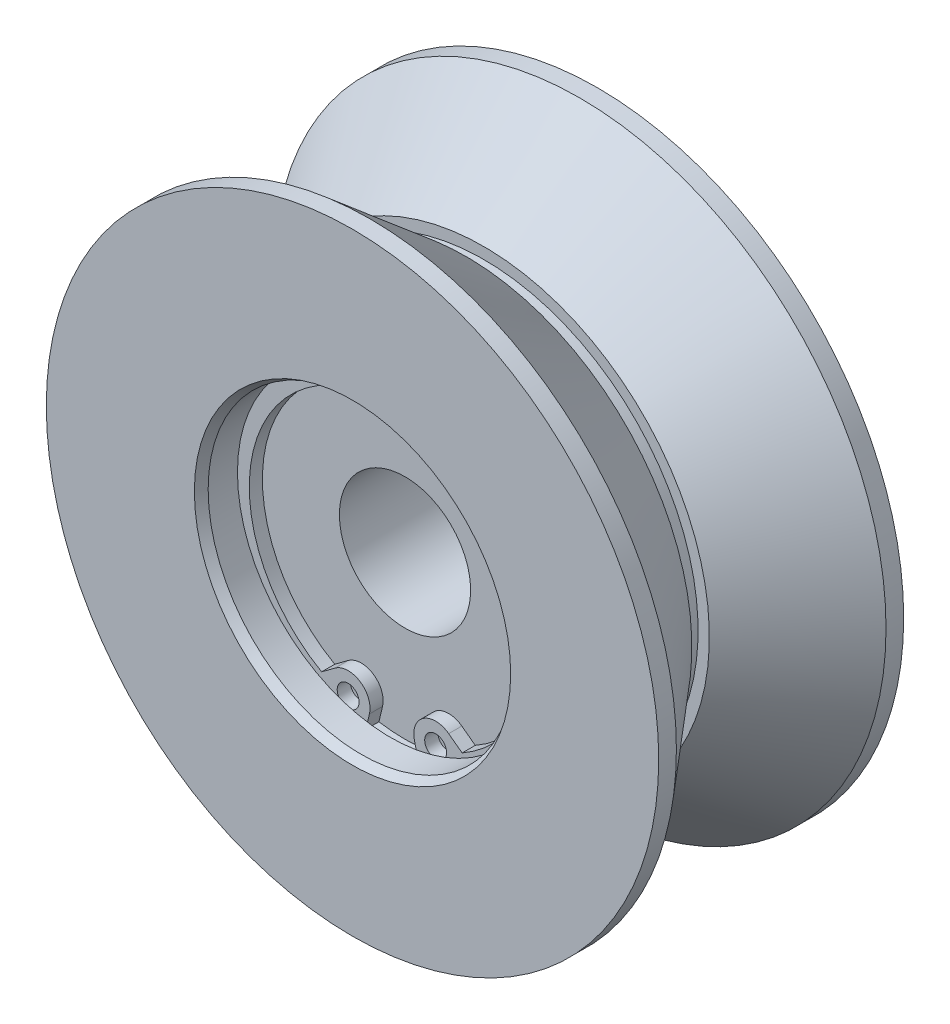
ISO-10303-21;
HEADER;
FILE_DESCRIPTION(('STEP AP214'),'2;1');
FILE_NAME('part.step','',(''),(''),'','','');
FILE_SCHEMA(('AUTOMOTIVE_DESIGN { 1 0 10303 214 1 1 1 1 }'));
ENDSEC;
DATA;
#1=APPLICATION_CONTEXT('core data for automotive mechanical design processes');
#2=APPLICATION_PROTOCOL_DEFINITION('international standard','automotive_design',2000,#1);
#3=PRODUCT_CONTEXT('',#1,'mechanical');
#4=PRODUCT('Part','Part','',(#3));
#5=PRODUCT_RELATED_PRODUCT_CATEGORY('part','',(#4));
#6=PRODUCT_DEFINITION_FORMATION('','',#4);
#7=PRODUCT_DEFINITION_CONTEXT('part definition',#1,'design');
#8=PRODUCT_DEFINITION('design','',#6,#7);
#9=PRODUCT_DEFINITION_SHAPE('','',#8);
#10=(LENGTH_UNIT() NAMED_UNIT(*) SI_UNIT(.MILLI.,.METRE.));
#11=(NAMED_UNIT(*) PLANE_ANGLE_UNIT() SI_UNIT($,.RADIAN.));
#12=(NAMED_UNIT(*) SI_UNIT($,.STERADIAN.) SOLID_ANGLE_UNIT());
#13=UNCERTAINTY_MEASURE_WITH_UNIT(LENGTH_MEASURE(1.E-05),#10,'distance_accuracy_value','');
#14=(GEOMETRIC_REPRESENTATION_CONTEXT(3) GLOBAL_UNCERTAINTY_ASSIGNED_CONTEXT((#13)) GLOBAL_UNIT_ASSIGNED_CONTEXT((#10,
#11,#12)) REPRESENTATION_CONTEXT('',''));
#15=CARTESIAN_POINT('',(0.,0.,0.));
#16=DIRECTION('',(0.,0.,1.));
#17=DIRECTION('',(1.,0.,0.));
#18=AXIS2_PLACEMENT_3D('',#15,#16,#17);
#19=CARTESIAN_POINT('',(5.,-15.9486107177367,9.6));
#20=DIRECTION('',(0.,0.,1.));
#21=DIRECTION('',(-1.,0.,0.));
#22=AXIS2_PLACEMENT_3D('',#19,#20,#21);
#23=CYLINDRICAL_SURFACE('',#22,2.5);
#24=DIRECTION('',(0.,0.,-1.));
#25=VECTOR('',#24,1.);
#26=CARTESIAN_POINT('',(2.5678231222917,-16.526983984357,9.6));
#27=LINE('',#26,#25);
#28=CARTESIAN_POINT('',(2.56782312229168,-16.526983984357,9.5));
#29=VERTEX_POINT('',#28);
#30=CARTESIAN_POINT('',(2.5678231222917,-16.526983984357,8.));
#31=VERTEX_POINT('',#30);
#32=EDGE_CURVE('E128',#29,#31,#27,.T.);
#33=ORIENTED_EDGE('',*,*,#32,.F.);
#34=CARTESIAN_POINT('',(5.,-15.9486107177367,9.5));
#35=DIRECTION('',(0.,0.,1.));
#36=DIRECTION('',(1.,0.,0.));
#37=AXIS2_PLACEMENT_3D('',#34,#35,#36);
#38=CIRCLE('',#37,2.5);
#39=CARTESIAN_POINT('',(6.49138441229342,-13.9421779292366,9.5));
#40=VERTEX_POINT('',#39);
#41=EDGE_CURVE('E205',#40,#29,#38,.T.);
#42=ORIENTED_EDGE('',*,*,#41,.F.);
#43=DIRECTION('',(0.,0.,-1.));
#44=VECTOR('',#43,1.);
#45=CARTESIAN_POINT('',(6.49138441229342,-13.9421779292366,9.6));
#46=LINE('',#45,#44);
#47=CARTESIAN_POINT('',(6.49138441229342,-13.9421779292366,8.));
#48=VERTEX_POINT('',#47);
#49=EDGE_CURVE('E145',#40,#48,#46,.T.);
#50=ORIENTED_EDGE('',*,*,#49,.T.);
#51=CARTESIAN_POINT('',(5.,-15.9486107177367,8.));
#52=DIRECTION('',(0.,0.,1.));
#53=DIRECTION('',(1.,0.,0.));
#54=AXIS2_PLACEMENT_3D('',#51,#52,#53);
#55=CIRCLE('',#54,2.5);
#56=EDGE_CURVE('E142',#48,#31,#55,.T.);
#57=ORIENTED_EDGE('',*,*,#56,.T.);
#58=EDGE_LOOP('',(#33,#42,#50,#57));
#59=FACE_BOUND('',#58,.T.);
#60=ADVANCED_FACE('F14',(#59),#23,.T.);
#61=CARTESIAN_POINT('',(6.49138441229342,-13.9421779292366,9.6));
#62=DIRECTION('',(-0.596553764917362,-0.802573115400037,0.));
#63=DIRECTION('',(-0.802573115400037,0.596553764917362,0.));
#64=AXIS2_PLACEMENT_3D('',#61,#62,#63);
#65=PLANE('',#64);
#66=DIRECTION('',(-0.802573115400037,0.596553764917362,0.));
#67=VECTOR('',#66,1.);
#68=CARTESIAN_POINT('',(8.02922574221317,-15.0852576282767,9.5));
#69=LINE('',#68,#67);
#70=CARTESIAN_POINT('',(8.02922574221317,-15.0852576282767,9.5));
#71=VERTEX_POINT('',#70);
#72=EDGE_CURVE('E233',#71,#40,#69,.T.);
#73=ORIENTED_EDGE('',*,*,#72,.F.);
#74=DIRECTION('',(0.,0.,-1.));
#75=VECTOR('',#74,1.);
#76=CARTESIAN_POINT('',(8.02922574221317,-15.0852576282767,9.6));
#77=LINE('',#76,#75);
#78=CARTESIAN_POINT('',(8.02922574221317,-15.0852576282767,8.));
#79=VERTEX_POINT('',#78);
#80=EDGE_CURVE('E141',#71,#79,#77,.T.);
#81=ORIENTED_EDGE('',*,*,#80,.T.);
#82=DIRECTION('',(-0.802573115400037,0.596553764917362,0.));
#83=VECTOR('',#82,1.);
#84=CARTESIAN_POINT('',(6.49138441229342,-13.9421779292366,8.));
#85=LINE('',#84,#83);
#86=EDGE_CURVE('E138',#79,#48,#85,.T.);
#87=ORIENTED_EDGE('',*,*,#86,.T.);
#88=ORIENTED_EDGE('',*,*,#49,.F.);
#89=EDGE_LOOP('',(#73,#81,#87,#88));
#90=FACE_BOUND('',#89,.T.);
#91=ADVANCED_FACE('F308',(#90),#65,.F.);
#92=CARTESIAN_POINT('',(0.,-0.9,9.6));
#93=DIRECTION('',(0.,0.,1.));
#94=DIRECTION('',(-1.,0.,0.));
#95=AXIS2_PLACEMENT_3D('',#92,#93,#94);
#96=CYLINDRICAL_SURFACE('',#95,16.3);
#97=CARTESIAN_POINT('',(0.,-0.9,9.5));
#98=DIRECTION('',(0.,0.,-1.));
#99=DIRECTION('',(1.,0.,0.));
#100=AXIS2_PLACEMENT_3D('',#97,#98,#99);
#101=CIRCLE('',#100,16.3);
#102=CARTESIAN_POINT('',(-8.02922574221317,-15.0852576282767,9.5));
#103=VERTEX_POINT('',#102);
#104=EDGE_CURVE('E104',#103,#71,#101,.T.);
#105=ORIENTED_EDGE('',*,*,#104,.F.);
#106=DIRECTION('',(0.,0.,-1.));
#107=VECTOR('',#106,1.);
#108=CARTESIAN_POINT('',(-8.02922574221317,-15.0852576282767,9.6));
#109=LINE('',#108,#107);
#110=CARTESIAN_POINT('',(-8.02922574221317,-15.0852576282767,8.));
#111=VERTEX_POINT('',#110);
#112=EDGE_CURVE('E103',#103,#111,#109,.T.);
#113=ORIENTED_EDGE('',*,*,#112,.T.);
#114=CARTESIAN_POINT('',(0.,-0.9,8.));
#115=DIRECTION('',(0.,0.,-1.));
#116=DIRECTION('',(0.,-1.,0.));
#117=AXIS2_PLACEMENT_3D('',#114,#115,#116);
#118=CIRCLE('',#117,16.3);
#119=EDGE_CURVE('E122',#111,#79,#118,.T.);
#120=ORIENTED_EDGE('',*,*,#119,.T.);
#121=ORIENTED_EDGE('',*,*,#80,.F.);
#122=EDGE_LOOP('',(#105,#113,#120,#121));
#123=FACE_BOUND('',#122,.T.);
#124=ADVANCED_FACE('F228',(#123),#96,.F.);
#125=CARTESIAN_POINT('',(-6.49138441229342,-13.9421779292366,9.6));
#126=DIRECTION('',(0.596553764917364,-0.802573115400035,0.));
#127=DIRECTION('',(0.,0.,-1.));
#128=AXIS2_PLACEMENT_3D('',#125,#126,#127);
#129=PLANE('',#128);
#130=DIRECTION('',(-0.802573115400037,-0.596553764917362,0.));
#131=VECTOR('',#130,1.);
#132=CARTESIAN_POINT('',(-6.49138441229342,-13.9421779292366,9.5));
#133=LINE('',#132,#131);
#134=CARTESIAN_POINT('',(-6.49138441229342,-13.9421779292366,9.5));
#135=VERTEX_POINT('',#134);
#136=EDGE_CURVE('E87',#135,#103,#133,.T.);
#137=ORIENTED_EDGE('',*,*,#136,.F.);
#138=DIRECTION('',(0.,0.,-1.));
#139=VECTOR('',#138,1.);
#140=CARTESIAN_POINT('',(-6.49138441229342,-13.9421779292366,9.6));
#141=LINE('',#140,#139);
#142=CARTESIAN_POINT('',(-6.49138441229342,-13.9421779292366,8.));
#143=VERTEX_POINT('',#142);
#144=EDGE_CURVE('E101',#135,#143,#141,.T.);
#145=ORIENTED_EDGE('',*,*,#144,.T.);
#146=DIRECTION('',(-0.802573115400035,-0.596553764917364,0.));
#147=VECTOR('',#146,1.);
#148=CARTESIAN_POINT('',(-6.49138441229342,-13.9421779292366,8.));
#149=LINE('',#148,#147);
#150=EDGE_CURVE('E110',#143,#111,#149,.T.);
#151=ORIENTED_EDGE('',*,*,#150,.T.);
#152=ORIENTED_EDGE('',*,*,#112,.F.);
#153=EDGE_LOOP('',(#137,#145,#151,#152));
#154=FACE_BOUND('',#153,.T.);
#155=ADVANCED_FACE('F100',(#154),#129,.F.);
#156=CARTESIAN_POINT('',(-5.,-15.9486107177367,9.6));
#157=DIRECTION('',(0.,0.,1.));
#158=DIRECTION('',(-1.,0.,0.));
#159=AXIS2_PLACEMENT_3D('',#156,#157,#158);
#160=CYLINDRICAL_SURFACE('',#159,2.5);
#161=ORIENTED_EDGE('',*,*,#144,.F.);
#162=CARTESIAN_POINT('',(-5.,-15.9486107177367,9.5));
#163=DIRECTION('',(0.,0.,1.));
#164=DIRECTION('',(1.,0.,0.));
#165=AXIS2_PLACEMENT_3D('',#162,#163,#164);
#166=CIRCLE('',#165,2.5);
#167=CARTESIAN_POINT('',(-2.56782312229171,-16.526983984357,9.5));
#168=VERTEX_POINT('',#167);
#169=EDGE_CURVE('E83',#168,#135,#166,.T.);
#170=ORIENTED_EDGE('',*,*,#169,.F.);
#171=DIRECTION('',(0.,0.,-1.));
#172=VECTOR('',#171,1.);
#173=CARTESIAN_POINT('',(-2.56782312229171,-16.526983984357,9.6));
#174=LINE('',#173,#172);
#175=CARTESIAN_POINT('',(-2.56782312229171,-16.526983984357,8.));
#176=VERTEX_POINT('',#175);
#177=EDGE_CURVE('E133',#168,#176,#174,.T.);
#178=ORIENTED_EDGE('',*,*,#177,.T.);
#179=CARTESIAN_POINT('',(-5.,-15.9486107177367,8.));
#180=DIRECTION('',(0.,0.,1.));
#181=DIRECTION('',(-1.,0.,0.));
#182=AXIS2_PLACEMENT_3D('',#179,#180,#181);
#183=CIRCLE('',#182,2.5);
#184=EDGE_CURVE('E107',#176,#143,#183,.T.);
#185=ORIENTED_EDGE('',*,*,#184,.T.);
#186=EDGE_LOOP('',(#161,#170,#178,#185));
#187=FACE_BOUND('',#186,.T.);
#188=ADVANCED_FACE('F106',(#187),#160,.T.);
#189=CARTESIAN_POINT('',(-2.56782312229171,-16.526983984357,9.6));
#190=DIRECTION('',(-0.97287075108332,0.231349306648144,0.));
#191=DIRECTION('',(0.,0.,1.));
#192=AXIS2_PLACEMENT_3D('',#189,#190,#191);
#193=PLANE('',#192);
#194=DIRECTION('',(0.,0.,-1.));
#195=VECTOR('',#194,1.);
#196=CARTESIAN_POINT('',(-2.97957431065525,-18.2584812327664,-15.4));
#197=LINE('',#196,#195);
#198=CARTESIAN_POINT('',(-2.97957431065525,-18.2584812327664,8.));
#199=VERTEX_POINT('',#198);
#200=CARTESIAN_POINT('',(-2.97957431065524,-18.2584812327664,9.5));
#201=VERTEX_POINT('',#200);
#202=EDGE_CURVE('E22',#199,#201,#197,.F.);
#203=ORIENTED_EDGE('',*,*,#202,.F.);
#204=DIRECTION('',(0.231349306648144,0.97287075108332,0.));
#205=VECTOR('',#204,1.);
#206=CARTESIAN_POINT('',(-2.56782312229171,-16.526983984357,8.));
#207=LINE('',#206,#205);
#208=EDGE_CURVE('E132',#199,#176,#207,.T.);
#209=ORIENTED_EDGE('',*,*,#208,.T.);
#210=ORIENTED_EDGE('',*,*,#177,.F.);
#211=DIRECTION('',(0.231349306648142,0.972870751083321,0.));
#212=VECTOR('',#211,1.);
#213=CARTESIAN_POINT('',(-3.07234735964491,-18.6486107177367,9.5));
#214=LINE('',#213,#212);
#215=EDGE_CURVE('E90',#201,#168,#214,.T.);
#216=ORIENTED_EDGE('',*,*,#215,.F.);
#217=EDGE_LOOP('',(#203,#209,#210,#216));
#218=FACE_BOUND('',#217,.T.);
#219=ADVANCED_FACE('F203',(#218),#193,.F.);
#220=CARTESIAN_POINT('',(2.5678231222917,-16.526983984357,9.6));
#221=DIRECTION('',(0.972870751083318,0.231349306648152,0.));
#222=DIRECTION('',(0.,0.,-1.));
#223=AXIS2_PLACEMENT_3D('',#220,#221,#222);
#224=PLANE('',#223);
#225=DIRECTION('',(0.,0.,-1.));
#226=VECTOR('',#225,1.);
#227=CARTESIAN_POINT('',(2.97957431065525,-18.2584812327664,-15.4));
#228=LINE('',#227,#226);
#229=CARTESIAN_POINT('',(2.97957431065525,-18.2584812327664,9.5));
#230=VERTEX_POINT('',#229);
#231=CARTESIAN_POINT('',(2.97957431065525,-18.2584812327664,8.));
#232=VERTEX_POINT('',#231);
#233=EDGE_CURVE('E9',#230,#232,#228,.T.);
#234=ORIENTED_EDGE('',*,*,#233,.F.);
#235=DIRECTION('',(0.231349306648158,-0.972870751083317,0.));
#236=VECTOR('',#235,1.);
#237=CARTESIAN_POINT('',(2.56782312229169,-16.526983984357,9.5));
#238=LINE('',#237,#236);
#239=EDGE_CURVE('E202',#29,#230,#238,.T.);
#240=ORIENTED_EDGE('',*,*,#239,.F.);
#241=ORIENTED_EDGE('',*,*,#32,.T.);
#242=DIRECTION('',(0.231349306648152,-0.972870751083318,0.));
#243=VECTOR('',#242,1.);
#244=CARTESIAN_POINT('',(2.5678231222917,-16.526983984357,8.));
#245=LINE('',#244,#243);
#246=EDGE_CURVE('E126',#31,#232,#245,.T.);
#247=ORIENTED_EDGE('',*,*,#246,.T.);
#248=EDGE_LOOP('',(#234,#240,#241,#247));
#249=FACE_BOUND('',#248,.T.);
#250=ADVANCED_FACE('F241',(#249),#224,.F.);
#251=CARTESIAN_POINT('',(-5.,-15.9486107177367,9.6));
#252=DIRECTION('',(0.,0.,1.));
#253=DIRECTION('',(-1.,0.,0.));
#254=AXIS2_PLACEMENT_3D('',#251,#252,#253);
#255=CYLINDRICAL_SURFACE('',#254,1.25);
#256=CARTESIAN_POINT('',(-5.,-15.9486107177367,8.));
#257=DIRECTION('',(0.,0.,-1.));
#258=DIRECTION('',(1.,0.,0.));
#259=AXIS2_PLACEMENT_3D('',#256,#257,#258);
#260=CIRCLE('',#259,1.25);
#261=CARTESIAN_POINT('',(-3.75,-15.9486107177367,8.));
#262=VERTEX_POINT('',#261);
#263=EDGE_CURVE('E134',#262,#262,#260,.T.);
#264=ORIENTED_EDGE('',*,*,#263,.T.);
#265=EDGE_LOOP('',(#264));
#266=FACE_BOUND('',#265,.T.);
#267=CARTESIAN_POINT('',(-5.,-15.9486107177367,9.5));
#268=DIRECTION('',(0.,0.,1.));
#269=DIRECTION('',(1.,0.,0.));
#270=AXIS2_PLACEMENT_3D('',#267,#268,#269);
#271=CIRCLE('',#270,1.25);
#272=CARTESIAN_POINT('',(-3.75,-15.9486107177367,9.5));
#273=VERTEX_POINT('',#272);
#274=EDGE_CURVE('E149',#273,#273,#271,.F.);
#275=ORIENTED_EDGE('',*,*,#274,.F.);
#276=EDGE_LOOP('',(#275));
#277=FACE_BOUND('',#276,.T.);
#278=ADVANCED_FACE('F272',(#266,#277),#255,.F.);
#279=CARTESIAN_POINT('',(5.,-15.9486107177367,9.6));
#280=DIRECTION('',(0.,0.,1.));
#281=DIRECTION('',(-1.,0.,0.));
#282=AXIS2_PLACEMENT_3D('',#279,#280,#281);
#283=CYLINDRICAL_SURFACE('',#282,1.25);
#284=CARTESIAN_POINT('',(5.,-15.9486107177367,8.));
#285=DIRECTION('',(0.,0.,1.));
#286=DIRECTION('',(1.,0.,0.));
#287=AXIS2_PLACEMENT_3D('',#284,#285,#286);
#288=CIRCLE('',#287,1.25);
#289=CARTESIAN_POINT('',(6.25,-15.9486107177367,8.));
#290=VERTEX_POINT('',#289);
#291=EDGE_CURVE('E111',#290,#290,#288,.T.);
#292=ORIENTED_EDGE('',*,*,#291,.F.);
#293=EDGE_LOOP('',(#292));
#294=FACE_BOUND('',#293,.T.);
#295=CARTESIAN_POINT('',(5.,-15.9486107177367,9.5));
#296=DIRECTION('',(0.,0.,1.));
#297=DIRECTION('',(1.,0.,0.));
#298=AXIS2_PLACEMENT_3D('',#295,#296,#297);
#299=CIRCLE('',#298,1.25);
#300=CARTESIAN_POINT('',(6.25,-15.9486107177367,9.5));
#301=VERTEX_POINT('',#300);
#302=EDGE_CURVE('E146',#301,#301,#299,.F.);
#303=ORIENTED_EDGE('',*,*,#302,.F.);
#304=EDGE_LOOP('',(#303));
#305=FACE_BOUND('',#304,.T.);
#306=ADVANCED_FACE('F268',(#294,#305),#283,.F.);
#307=CARTESIAN_POINT('',(-5.,-15.9486107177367,9.5));
#308=DIRECTION('',(0.,0.,1.));
#309=DIRECTION('',(1.,0.,0.));
#310=AXIS2_PLACEMENT_3D('',#307,#308,#309);
#311=PLANE('',#310);
#312=ORIENTED_EDGE('',*,*,#302,.T.);
#313=EDGE_LOOP('',(#312));
#314=FACE_BOUND('',#313,.T.);
#315=ORIENTED_EDGE('',*,*,#274,.T.);
#316=EDGE_LOOP('',(#315));
#317=FACE_BOUND('',#316,.T.);
#318=ORIENTED_EDGE('',*,*,#239,.T.);
#319=CARTESIAN_POINT('',(0.,0.,9.5));
#320=DIRECTION('',(0.,0.,1.));
#321=DIRECTION('',(1.,0.,0.));
#322=AXIS2_PLACEMENT_3D('',#319,#320,#321);
#323=CIRCLE('',#322,18.5);
#324=EDGE_CURVE('E118',#230,#201,#323,.T.);
#325=ORIENTED_EDGE('',*,*,#324,.T.);
#326=ORIENTED_EDGE('',*,*,#215,.T.);
#327=ORIENTED_EDGE('',*,*,#169,.T.);
#328=ORIENTED_EDGE('',*,*,#136,.T.);
#329=ORIENTED_EDGE('',*,*,#104,.T.);
#330=ORIENTED_EDGE('',*,*,#72,.T.);
#331=ORIENTED_EDGE('',*,*,#41,.T.);
#332=EDGE_LOOP('',(#318,#325,#326,#327,#328,#329,#330,#331));
#333=FACE_BOUND('',#332,.T.);
#334=ADVANCED_FACE('F86',(#314,#317,#333),#311,.T.);
#335=CARTESIAN_POINT('',(0.,0.,-15.4));
#336=DIRECTION('',(0.,0.,-1.));
#337=DIRECTION('',(-1.,0.,0.));
#338=AXIS2_PLACEMENT_3D('',#335,#336,#337);
#339=CYLINDRICAL_SURFACE('',#338,24.5);
#340=CARTESIAN_POINT('',(0.,0.,-1.));
#341=DIRECTION('',(0.,0.,-1.));
#342=DIRECTION('',(-1.,0.,0.));
#343=AXIS2_PLACEMENT_3D('',#340,#341,#342);
#344=CIRCLE('',#343,24.5);
#345=CARTESIAN_POINT('',(-24.5,0.,-1.));
#346=VERTEX_POINT('',#345);
#347=EDGE_CURVE('E180',#346,#346,#344,.T.);
#348=ORIENTED_EDGE('',*,*,#347,.F.);
#349=EDGE_LOOP('',(#348));
#350=FACE_BOUND('',#349,.T.);
#351=CARTESIAN_POINT('',(0.,0.,1.));
#352=DIRECTION('',(0.,0.,-1.));
#353=DIRECTION('',(-1.,0.,0.));
#354=AXIS2_PLACEMENT_3D('',#351,#352,#353);
#355=CIRCLE('',#354,24.5);
#356=CARTESIAN_POINT('',(-24.5,0.,1.));
#357=VERTEX_POINT('',#356);
#358=EDGE_CURVE('E177',#357,#357,#355,.T.);
#359=ORIENTED_EDGE('',*,*,#358,.T.);
#360=EDGE_LOOP('',(#359));
#361=FACE_BOUND('',#360,.T.);
#362=ADVANCED_FACE('F358',(#350,#361),#339,.T.);
#363=CARTESIAN_POINT('',(0.,25.7866860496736,-1.));
#364=DIRECTION('',(0.,0.,-1.));
#365=DIRECTION('',(-1.,0.,0.));
#366=AXIS2_PLACEMENT_3D('',#363,#364,#365);
#367=PLANE('',#366);
#368=CARTESIAN_POINT('',(0.,0.,-1.));
#369=DIRECTION('',(0.,0.,-1.));
#370=DIRECTION('',(-1.,0.,0.));
#371=AXIS2_PLACEMENT_3D('',#368,#369,#370);
#372=CIRCLE('',#371,25.7866860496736);
#373=CARTESIAN_POINT('',(-25.7866860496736,0.,-1.));
#374=VERTEX_POINT('',#373);
#375=EDGE_CURVE('E183',#374,#374,#372,.T.);
#376=ORIENTED_EDGE('',*,*,#375,.F.);
#377=EDGE_LOOP('',(#376));
#378=FACE_BOUND('',#377,.T.);
#379=ORIENTED_EDGE('',*,*,#347,.T.);
#380=EDGE_LOOP('',(#379));
#381=FACE_BOUND('',#380,.T.);
#382=ADVANCED_FACE('F368',(#378,#381),#367,.F.);
#383=CARTESIAN_POINT('',(0.,24.5,1.));
#384=DIRECTION('',(0.,0.,1.));
#385=DIRECTION('',(1.,0.,0.));
#386=AXIS2_PLACEMENT_3D('',#383,#384,#385);
#387=PLANE('',#386);
#388=ORIENTED_EDGE('',*,*,#358,.F.);
#389=EDGE_LOOP('',(#388));
#390=FACE_BOUND('',#389,.T.);
#391=CARTESIAN_POINT('',(0.,0.,1.));
#392=DIRECTION('',(0.,0.,-1.));
#393=DIRECTION('',(-1.,0.,0.));
#394=AXIS2_PLACEMENT_3D('',#391,#392,#393);
#395=CIRCLE('',#394,25.7866860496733);
#396=CARTESIAN_POINT('',(-25.7866860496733,0.,1.));
#397=VERTEX_POINT('',#396);
#398=EDGE_CURVE('E174',#397,#397,#395,.T.);
#399=ORIENTED_EDGE('',*,*,#398,.T.);
#400=EDGE_LOOP('',(#399));
#401=FACE_BOUND('',#400,.T.);
#402=ADVANCED_FACE('F371',(#390,#401),#387,.F.);
#403=CARTESIAN_POINT('',(0.,0.,-1.));
#404=DIRECTION('',(0.,0.,-1.));
#405=DIRECTION('',(-1.,0.,0.));
#406=AXIS2_PLACEMENT_3D('',#403,#404,#405);
#407=CONICAL_SURFACE('',#406,25.7866860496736,0.698131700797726);
#408=CARTESIAN_POINT('',(0.,0.,-11.98));
#409=DIRECTION('',(0.,0.,-1.));
#410=DIRECTION('',(-1.,0.,0.));
#411=AXIS2_PLACEMENT_3D('',#408,#409,#410);
#412=CIRCLE('',#411,35.);
#413=CARTESIAN_POINT('',(-35.,0.,-11.98));
#414=VERTEX_POINT('',#413);
#415=EDGE_CURVE('E186',#414,#414,#412,.T.);
#416=ORIENTED_EDGE('',*,*,#415,.F.);
#417=EDGE_LOOP('',(#416));
#418=FACE_BOUND('',#417,.T.);
#419=ORIENTED_EDGE('',*,*,#375,.T.);
#420=EDGE_LOOP('',(#419));
#421=FACE_BOUND('',#420,.T.);
#422=ADVANCED_FACE('F380',(#418,#421),#407,.T.);
#423=CARTESIAN_POINT('',(0.,0.,11.98));
#424=DIRECTION('',(0.,0.,1.));
#425=DIRECTION('',(1.,0.,0.));
#426=AXIS2_PLACEMENT_3D('',#423,#424,#425);
#427=CONICAL_SURFACE('',#426,35.,0.698131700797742);
#428=ORIENTED_EDGE('',*,*,#398,.F.);
#429=EDGE_LOOP('',(#428));
#430=FACE_BOUND('',#429,.T.);
#431=CARTESIAN_POINT('',(0.,0.,11.98));
#432=DIRECTION('',(0.,0.,-1.));
#433=DIRECTION('',(-1.,0.,0.));
#434=AXIS2_PLACEMENT_3D('',#431,#432,#433);
#435=CIRCLE('',#434,35.);
#436=CARTESIAN_POINT('',(-35.,0.,11.98));
#437=VERTEX_POINT('',#436);
#438=EDGE_CURVE('E189',#437,#437,#435,.T.);
#439=ORIENTED_EDGE('',*,*,#438,.T.);
#440=EDGE_LOOP('',(#439));
#441=FACE_BOUND('',#440,.T.);
#442=ADVANCED_FACE('F389',(#430,#441),#427,.T.);
#443=CARTESIAN_POINT('',(0.,0.,14.));
#444=DIRECTION('',(0.,0.,-1.));
#445=DIRECTION('',(-1.,0.,0.));
#446=AXIS2_PLACEMENT_3D('',#443,#444,#445);
#447=CYLINDRICAL_SURFACE('',#446,35.);
#448=ORIENTED_EDGE('',*,*,#415,.T.);
#449=EDGE_LOOP('',(#448));
#450=FACE_BOUND('',#449,.T.);
#451=CARTESIAN_POINT('',(0.,0.,-14.));
#452=DIRECTION('',(0.,0.,1.));
#453=DIRECTION('',(1.,0.,0.));
#454=AXIS2_PLACEMENT_3D('',#451,#452,#453);
#455=CIRCLE('',#454,35.);
#456=CARTESIAN_POINT('',(35.,0.,-14.));
#457=VERTEX_POINT('',#456);
#458=EDGE_CURVE('E158',#457,#457,#455,.T.);
#459=ORIENTED_EDGE('',*,*,#458,.T.);
#460=EDGE_LOOP('',(#459));
#461=FACE_BOUND('',#460,.T.);
#462=ADVANCED_FACE('F404',(#450,#461),#447,.T.);
#463=ORIENTED_EDGE('',*,*,#438,.F.);
#464=EDGE_LOOP('',(#463));
#465=FACE_BOUND('',#464,.T.);
#466=CARTESIAN_POINT('',(0.,0.,14.));
#467=DIRECTION('',(0.,0.,1.));
#468=DIRECTION('',(1.,0.,0.));
#469=AXIS2_PLACEMENT_3D('',#466,#467,#468);
#470=CIRCLE('',#469,35.);
#471=CARTESIAN_POINT('',(35.,0.,14.));
#472=VERTEX_POINT('',#471);
#473=EDGE_CURVE('E157',#472,#472,#470,.T.);
#474=ORIENTED_EDGE('',*,*,#473,.F.);
#475=EDGE_LOOP('',(#474));
#476=FACE_BOUND('',#475,.T.);
#477=ADVANCED_FACE('F414',(#465,#476),#447,.T.);
#478=CARTESIAN_POINT('',(0.,0.,-14.));
#479=DIRECTION('',(0.,0.,1.));
#480=DIRECTION('',(1.,0.,0.));
#481=AXIS2_PLACEMENT_3D('',#478,#479,#480);
#482=PLANE('',#481);
#483=CARTESIAN_POINT('',(0.,0.,-14.));
#484=DIRECTION('',(0.,0.,-1.));
#485=DIRECTION('',(-1.,0.,0.));
#486=AXIS2_PLACEMENT_3D('',#483,#484,#485);
#487=CIRCLE('',#486,14.5);
#488=CARTESIAN_POINT('',(-14.5,0.,-14.));
#489=VERTEX_POINT('',#488);
#490=EDGE_CURVE('E161',#489,#489,#487,.T.);
#491=ORIENTED_EDGE('',*,*,#490,.F.);
#492=EDGE_LOOP('',(#491));
#493=FACE_BOUND('',#492,.T.);
#494=ORIENTED_EDGE('',*,*,#458,.F.);
#495=EDGE_LOOP('',(#494));
#496=FACE_BOUND('',#495,.T.);
#497=ADVANCED_FACE('F424',(#493,#496),#482,.F.);
#498=CARTESIAN_POINT('',(0.,0.,14.));
#499=DIRECTION('',(0.,0.,1.));
#500=DIRECTION('',(1.,0.,0.));
#501=AXIS2_PLACEMENT_3D('',#498,#499,#500);
#502=PLANE('',#501);
#503=CARTESIAN_POINT('',(0.,0.,14.));
#504=DIRECTION('',(0.,0.,-1.));
#505=DIRECTION('',(-1.,0.,0.));
#506=AXIS2_PLACEMENT_3D('',#503,#504,#505);
#507=CIRCLE('',#506,18.0773502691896);
#508=CARTESIAN_POINT('',(-18.0773502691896,0.,14.));
#509=VERTEX_POINT('',#508);
#510=EDGE_CURVE('E171',#509,#509,#507,.T.);
#511=ORIENTED_EDGE('',*,*,#510,.T.);
#512=EDGE_LOOP('',(#511));
#513=FACE_BOUND('',#512,.T.);
#514=ORIENTED_EDGE('',*,*,#473,.T.);
#515=EDGE_LOOP('',(#514));
#516=FACE_BOUND('',#515,.T.);
#517=ADVANCED_FACE('F417',(#513,#516),#502,.T.);
#518=CARTESIAN_POINT('',(0.,0.,-15.4));
#519=DIRECTION('',(0.,0.,-1.));
#520=DIRECTION('',(-1.,0.,0.));
#521=AXIS2_PLACEMENT_3D('',#518,#519,#520);
#522=CYLINDRICAL_SURFACE('',#521,14.5);
#523=CARTESIAN_POINT('',(0.,0.,-8.));
#524=DIRECTION('',(0.,0.,-1.));
#525=DIRECTION('',(-1.,0.,0.));
#526=AXIS2_PLACEMENT_3D('',#523,#524,#525);
#527=CIRCLE('',#526,14.5);
#528=CARTESIAN_POINT('',(-14.5,0.,-8.));
#529=VERTEX_POINT('',#528);
#530=EDGE_CURVE('E192',#529,#529,#527,.T.);
#531=ORIENTED_EDGE('',*,*,#530,.F.);
#532=EDGE_LOOP('',(#531));
#533=FACE_BOUND('',#532,.T.);
#534=ORIENTED_EDGE('',*,*,#490,.T.);
#535=EDGE_LOOP('',(#534));
#536=FACE_BOUND('',#535,.T.);
#537=ADVANCED_FACE('F435',(#533,#536),#522,.F.);
#538=CARTESIAN_POINT('',(0.,0.,13.));
#539=DIRECTION('',(0.,0.,1.));
#540=DIRECTION('',(1.,0.,0.));
#541=AXIS2_PLACEMENT_3D('',#538,#539,#540);
#542=CONICAL_SURFACE('',#541,17.5,0.5235987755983);
#543=ORIENTED_EDGE('',*,*,#510,.F.);
#544=EDGE_LOOP('',(#543));
#545=FACE_BOUND('',#544,.T.);
#546=CARTESIAN_POINT('',(0.,0.,13.));
#547=DIRECTION('',(0.,0.,-1.));
#548=DIRECTION('',(-1.,0.,0.));
#549=AXIS2_PLACEMENT_3D('',#546,#547,#548);
#550=CIRCLE('',#549,17.5);
#551=CARTESIAN_POINT('',(-17.5,0.,13.));
#552=VERTEX_POINT('',#551);
#553=EDGE_CURVE('E168',#552,#552,#550,.T.);
#554=ORIENTED_EDGE('',*,*,#553,.T.);
#555=EDGE_LOOP('',(#554));
#556=FACE_BOUND('',#555,.T.);
#557=ADVANCED_FACE('F407',(#545,#556),#542,.F.);
#558=CARTESIAN_POINT('',(0.,7.5,-8.));
#559=DIRECTION('',(0.,0.,-1.));
#560=DIRECTION('',(-1.,0.,0.));
#561=AXIS2_PLACEMENT_3D('',#558,#559,#560);
#562=PLANE('',#561);
#563=CARTESIAN_POINT('',(0.,0.,-8.));
#564=DIRECTION('',(0.,0.,-1.));
#565=DIRECTION('',(-1.,0.,0.));
#566=AXIS2_PLACEMENT_3D('',#563,#564,#565);
#567=CIRCLE('',#566,7.5);
#568=CARTESIAN_POINT('',(-7.5,0.,-8.));
#569=VERTEX_POINT('',#568);
#570=EDGE_CURVE('E95',#569,#569,#567,.T.);
#571=ORIENTED_EDGE('',*,*,#570,.F.);
#572=EDGE_LOOP('',(#571));
#573=FACE_BOUND('',#572,.T.);
#574=ORIENTED_EDGE('',*,*,#530,.T.);
#575=EDGE_LOOP('',(#574));
#576=FACE_BOUND('',#575,.T.);
#577=ADVANCED_FACE('F426',(#573,#576),#562,.T.);
#578=CARTESIAN_POINT('',(0.,0.,-15.4));
#579=DIRECTION('',(0.,0.,-1.));
#580=DIRECTION('',(-1.,0.,0.));
#581=AXIS2_PLACEMENT_3D('',#578,#579,#580);
#582=CYLINDRICAL_SURFACE('',#581,17.5);
#583=ORIENTED_EDGE('',*,*,#553,.F.);
#584=EDGE_LOOP('',(#583));
#585=FACE_BOUND('',#584,.T.);
#586=CARTESIAN_POINT('',(0.,0.,9.65));
#587=DIRECTION('',(0.,0.,-1.));
#588=DIRECTION('',(-1.,0.,0.));
#589=AXIS2_PLACEMENT_3D('',#586,#587,#588);
#590=CIRCLE('',#589,17.5);
#591=CARTESIAN_POINT('',(-17.5,0.,9.65));
#592=VERTEX_POINT('',#591);
#593=EDGE_CURVE('E151',#592,#592,#590,.T.);
#594=ORIENTED_EDGE('',*,*,#593,.T.);
#595=EDGE_LOOP('',(#594));
#596=FACE_BOUND('',#595,.T.);
#597=ADVANCED_FACE('F452',(#585,#596),#582,.F.);
#598=CARTESIAN_POINT('',(0.,0.,-31.8790581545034));
#599=DIRECTION('',(0.,0.,-1.));
#600=DIRECTION('',(-1.,0.,0.));
#601=AXIS2_PLACEMENT_3D('',#598,#599,#600);
#602=CYLINDRICAL_SURFACE('',#601,7.5);
#603=ORIENTED_EDGE('',*,*,#570,.T.);
#604=EDGE_LOOP('',(#603));
#605=FACE_BOUND('',#604,.T.);
#606=CARTESIAN_POINT('',(0.,0.,8.));
#607=DIRECTION('',(0.,0.,-1.));
#608=DIRECTION('',(-1.,0.,0.));
#609=AXIS2_PLACEMENT_3D('',#606,#607,#608);
#610=CIRCLE('',#609,7.5);
#611=CARTESIAN_POINT('',(-7.5,0.,8.));
#612=VERTEX_POINT('',#611);
#613=EDGE_CURVE('E193',#612,#612,#610,.T.);
#614=ORIENTED_EDGE('',*,*,#613,.F.);
#615=EDGE_LOOP('',(#614));
#616=FACE_BOUND('',#615,.T.);
#617=ADVANCED_FACE('F468',(#605,#616),#602,.F.);
#618=CARTESIAN_POINT('',(0.,7.5,8.));
#619=DIRECTION('',(0.,0.,1.));
#620=DIRECTION('',(1.,0.,0.));
#621=AXIS2_PLACEMENT_3D('',#618,#619,#620);
#622=PLANE('',#621);
#623=ORIENTED_EDGE('',*,*,#613,.T.);
#624=EDGE_LOOP('',(#623));
#625=FACE_BOUND('',#624,.T.);
#626=ORIENTED_EDGE('',*,*,#246,.F.);
#627=ORIENTED_EDGE('',*,*,#56,.F.);
#628=ORIENTED_EDGE('',*,*,#86,.F.);
#629=ORIENTED_EDGE('',*,*,#119,.F.);
#630=ORIENTED_EDGE('',*,*,#150,.F.);
#631=ORIENTED_EDGE('',*,*,#184,.F.);
#632=ORIENTED_EDGE('',*,*,#208,.F.);
#633=CARTESIAN_POINT('',(0.,0.,8.));
#634=DIRECTION('',(0.,0.,-1.));
#635=DIRECTION('',(-1.,0.,0.));
#636=AXIS2_PLACEMENT_3D('',#633,#634,#635);
#637=CIRCLE('',#636,18.5);
#638=EDGE_CURVE('E166',#232,#199,#637,.T.);
#639=ORIENTED_EDGE('',*,*,#638,.F.);
#640=EDGE_LOOP('',(#626,#627,#628,#629,#630,#631,#632,#639));
#641=FACE_BOUND('',#640,.T.);
#642=ADVANCED_FACE('F16',(#625,#641),#622,.T.);
#643=CARTESIAN_POINT('',(0.,0.,9.65));
#644=DIRECTION('',(0.,0.,-1.));
#645=DIRECTION('',(-1.,0.,0.));
#646=AXIS2_PLACEMENT_3D('',#643,#644,#645);
#647=PLANE('',#646);
#648=CARTESIAN_POINT('',(0.,0.,9.65));
#649=DIRECTION('',(0.,0.,-1.));
#650=DIRECTION('',(-1.,0.,0.));
#651=AXIS2_PLACEMENT_3D('',#648,#649,#650);
#652=CIRCLE('',#651,18.5);
#653=CARTESIAN_POINT('',(-18.5,0.,9.65));
#654=VERTEX_POINT('',#653);
#655=EDGE_CURVE('E154',#654,#654,#652,.T.);
#656=ORIENTED_EDGE('',*,*,#655,.T.);
#657=EDGE_LOOP('',(#656));
#658=FACE_BOUND('',#657,.T.);
#659=ORIENTED_EDGE('',*,*,#593,.F.);
#660=EDGE_LOOP('',(#659));
#661=FACE_BOUND('',#660,.T.);
#662=ADVANCED_FACE('F361',(#658,#661),#647,.T.);
#663=CARTESIAN_POINT('',(0.,0.,-15.4));
#664=DIRECTION('',(0.,0.,-1.));
#665=DIRECTION('',(-1.,0.,0.));
#666=AXIS2_PLACEMENT_3D('',#663,#664,#665);
#667=CYLINDRICAL_SURFACE('',#666,18.5);
#668=ORIENTED_EDGE('',*,*,#655,.F.);
#669=EDGE_LOOP('',(#668));
#670=FACE_BOUND('',#669,.T.);
#671=ORIENTED_EDGE('',*,*,#324,.F.);
#672=ORIENTED_EDGE('',*,*,#233,.T.);
#673=ORIENTED_EDGE('',*,*,#638,.T.);
#674=ORIENTED_EDGE('',*,*,#202,.T.);
#675=EDGE_LOOP('',(#671,#672,#673,#674));
#676=FACE_BOUND('',#675,.T.);
#677=ADVANCED_FACE('F199',(#670,#676),#667,.F.);
#678=ORIENTED_EDGE('',*,*,#291,.T.);
#679=EDGE_LOOP('',(#678));
#680=FACE_BOUND('',#679,.T.);
#681=ADVANCED_FACE('F493',(#680),#622,.T.);
#682=ORIENTED_EDGE('',*,*,#263,.F.);
#683=EDGE_LOOP('',(#682));
#684=FACE_BOUND('',#683,.T.);
#685=ADVANCED_FACE('F492',(#684),#622,.T.);
#686=CLOSED_SHELL('',(#60,#91,#124,#155,#188,#219,#250,#278,#306,#334,#362,#382,#402,#422,#442,
#462,#477,#497,#517,#537,#557,#577,#597,#617,#642,#662,#677,#681,#685));
#687=MANIFOLD_SOLID_BREP('B1',#686);
#688=ADVANCED_BREP_SHAPE_REPRESENTATION('',(#18,#687),#14);
#689=SHAPE_DEFINITION_REPRESENTATION(#9,#688);
ENDSEC;
END-ISO-10303-21;
